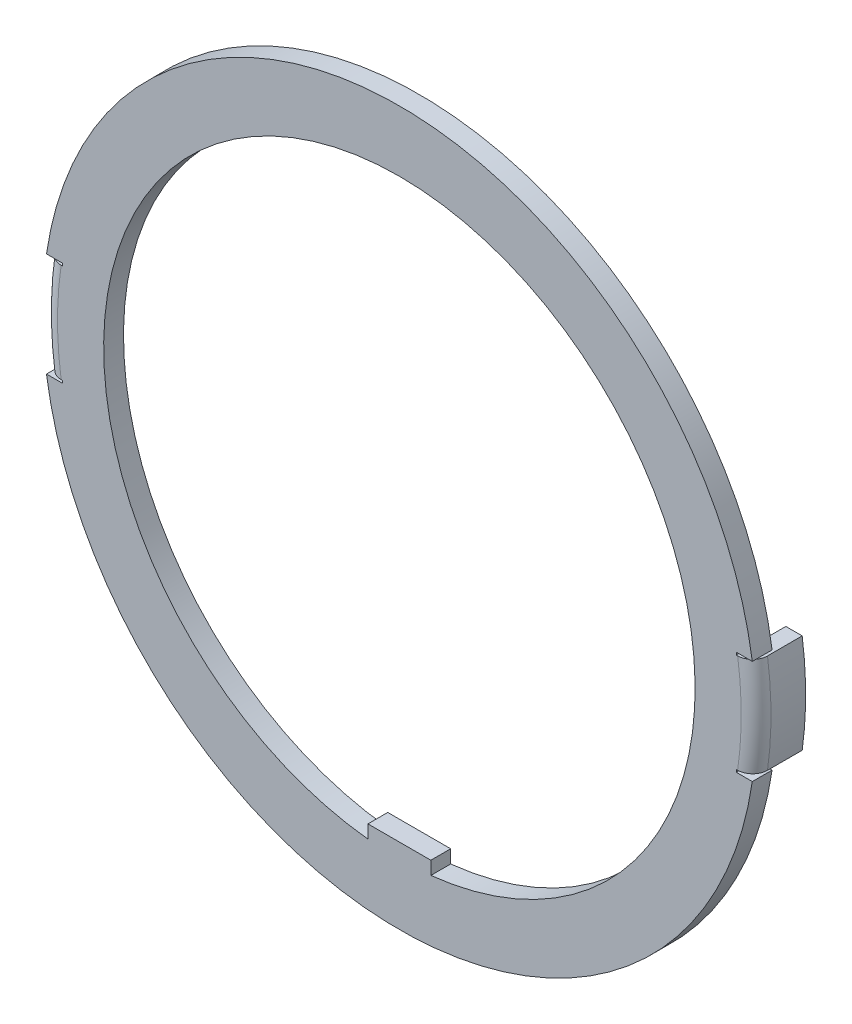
from build123d import *

# Parameters (mm, degrees)
SKETCH1_R           = 18
BOSS_EXTRUDE1_DEPTH = 1
BOSS_EXTRUDE2_START = 1.5
BOSS_EXTRUDE2_DEPTH = 1.5
SKETCH3_W           = 1.945582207
SKETCH3_H           = 0.125
CUT_EXTRUDE1_DEPTH  = 1
FILLET1_R           = 0.75


with BuildPart() as part:
    # Sketch1 → Boss-Extrude1 (new body)
    with BuildSketch(Plane.XY):
        Circle(SKETCH1_R)
        with BuildLine():
            Line((-1.5875, -14.837818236), (-1.5875, -14.1725))
            Line((-1.5875, -14.1725), (1.5875, -14.1725))
            Line((1.5875, -14.1725), (1.5875, -14.837818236))
            ThreePointArc((1.5875, -14.837818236), (0, 14.9225), (-1.5875, -14.837818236))
        make_face(mode=Mode.SUBTRACT)
    extrude(amount=BOSS_EXTRUDE1_DEPTH)

    # Sketch2 → Boss-Extrude2 (add)
    with BuildSketch(Plane(origin=(0, 0, 0), x_dir=(-1, 0, 0), z_dir=(0, 0, -1)).offset(BOSS_EXTRUDE2_START)):
        with BuildLine():
            Line((17.00054347, 2.5), (17.82554347, 2.5))
            ThreePointArc((17.82554347, 2.5), (18, 0), (17.82554347, -2.5))
            Line((17.82554347, -2.5), (17.00054347, -2.5))
            Line((17.00054347, -2.5), (17.00054347, 2.5))
        make_face()
        with BuildLine():
            Line((-17.00054347, -2.5), (-17.82554347, -2.5))
            ThreePointArc((-17.82554347, -2.5), (-18, 0), (-17.82554347, 2.5))
            Line((-17.82554347, 2.5), (-17.00054347, 2.5))
            Line((-17.00054347, 2.5), (-17.00054347, -2.5))
        make_face()
    extrude(amount=-BOSS_EXTRUDE2_DEPTH)

    # Sketch3 → Cut-Extrude1 (cut)
    with BuildSketch(Plane.XY.offset(1)):
        with Locations((17.973334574, 2.5625)):
            Rectangle(SKETCH3_W, SKETCH3_H)
        with Locations((17.973334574, -2.5625)):
            Rectangle(SKETCH3_W, SKETCH3_H)
        with Locations((-17.973334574, -2.5625)):
            Rectangle(SKETCH3_W, SKETCH3_H)
        with Locations((-17.973334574, 2.5625)):
            Rectangle(SKETCH3_W, SKETCH3_H)
    extrude(amount=-CUT_EXTRUDE1_DEPTH, mode=Mode.SUBTRACT)

    # Fillet1
    fillet1_edges = [part.edges().sort_by_distance(p)[0] for p in [
        (18, 0, 1),
        (-18, 0, 1),
    ]]
    fillet(fillet1_edges, radius=FILLET1_R)


solid = part.part
